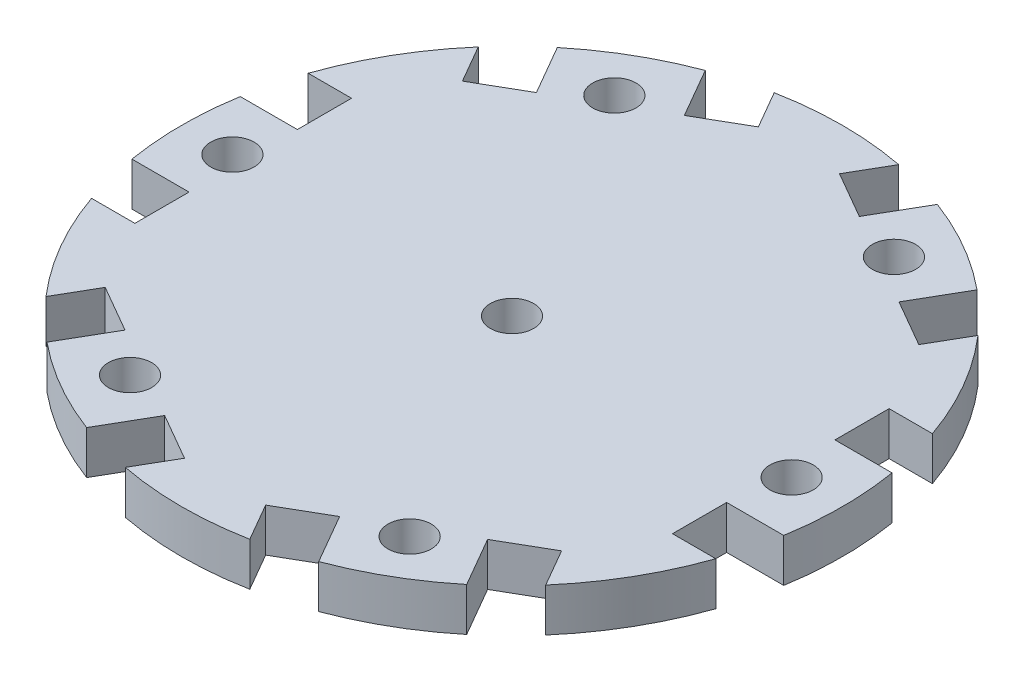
from build123d import *

# Parameters (mm, degrees)
CROQUIS1_R              = 30.5
SALIENTE_EXTRUIR1_DEPTH = 4
CROQUIS2_R              = 2
CORTAR_EXTRUIR1_DEPTH   = 4
CORTAR_EXTRUIR3_START   = -4
CORTAR_EXTRUIR3_DEPTH   = 4
CORTAR_EXTRUIR4_DEPTH   = 10


with BuildPart() as part:
    # Croquis1 → Saliente-Extruir1 (new body)
    with BuildSketch(Plane(origin=(0, 0, 0), x_dir=(1, 0, 0), z_dir=(0, 1, 0))):
        with Locations(Location((0, 0, 0), (0, 0, 270))):
            Circle(CROQUIS1_R)
    extrude(amount=SALIENTE_EXTRUIR1_DEPTH)

    # Croquis2 → Cortar-Extruir1 (cut)
    with BuildSketch(Plane(origin=(0, 4, 0), x_dir=(1, 0, 0), z_dir=(0, 1, 0))):
        with Locations(Location((0, 0, 0), (0, 0, 270))):
            Circle(CROQUIS2_R)
    extrude(amount=-CORTAR_EXTRUIR1_DEPTH, mode=Mode.SUBTRACT)

    # Croquis5 → Cortar-Extruir3 (cut)
    with BuildSketch(Plane(origin=(0, 4, 0), x_dir=(1, 0, 0), z_dir=(0, 1, 0)).offset(CORTAR_EXTRUIR3_START)):
        with BuildLine():
            ThreePointArc((-28.814059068, 10), (-29.556634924, 7.526973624), (-30.087372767, 5))
            Line((-30.087372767, 5), (-28.814059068, 5))
            Line((-28.814059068, 5), (-24.814059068, 5))
            Line((-24.814059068, 5), (-24.814059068, 10))
            Line((-24.814059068, 10), (-28.814059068, 10))
        make_face()
        with BuildLine():
            Line((28.814059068, 5), (30.087372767, 5))
            ThreePointArc((30.087372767, 5), (29.556634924, 7.526973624), (28.814059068, 10))
            Line((28.814059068, 10), (24.814059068, 10))
            Line((24.814059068, 10), (24.814059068, 5))
            Line((24.814059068, 5), (28.814059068, 5))
        make_face()
        with BuildLine():
            Line((30.087372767, -5), (28.814059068, -5))
            Line((28.814059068, -5), (24.814059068, -5))
            Line((24.814059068, -5), (24.814059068, -10))
            Line((24.814059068, -10), (28.814059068, -10))
            ThreePointArc((28.814059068, -10), (29.556634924, -7.526973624), (30.087372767, -5))
        make_face()
        with BuildLine():
            ThreePointArc((19.373813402, -23.556429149), (21.296867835, -21.833309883), (23.067283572, -19.953707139))
            Line((23.067283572, -19.953707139), (21.067283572, -16.489605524))
            Line((21.067283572, -16.489605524), (16.737156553, -18.989605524))
            Line((16.737156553, -18.989605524), (18.737156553, -22.453707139))
            Line((18.737156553, -22.453707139), (19.373813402, -23.556429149))
        make_face()
        with BuildLine():
            ThreePointArc((5.746775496, -29.953707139), (8.25976709, -29.360283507), (10.713559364, -28.556429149))
            Line((10.713559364, -28.556429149), (10.076902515, -27.453707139))
            Line((10.076902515, -27.453707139), (8.076902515, -23.989605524))
            Line((8.076902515, -23.989605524), (3.746775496, -26.489605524))
            Line((3.746775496, -26.489605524), (5.746775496, -29.953707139))
        make_face()
        with BuildLine():
            ThreePointArc((-10.713559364, -28.556429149), (-8.25976709, -29.360283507), (-5.746775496, -29.953707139))
            Line((-5.746775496, -29.953707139), (-3.746775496, -26.489605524))
            Line((-3.746775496, -26.489605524), (-8.076902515, -23.989605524))
            Line((-8.076902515, -23.989605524), (-10.076902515, -27.453707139))
            Line((-10.076902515, -27.453707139), (-10.713559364, -28.556429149))
        make_face()
        with BuildLine():
            ThreePointArc((-23.067283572, -19.953707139), (-21.296867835, -21.833309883), (-19.373813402, -23.556429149))
            Line((-19.373813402, -23.556429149), (-18.737156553, -22.453707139))
            Line((-18.737156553, -22.453707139), (-16.737156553, -18.989605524))
            Line((-16.737156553, -18.989605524), (-21.067283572, -16.489605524))
            Line((-21.067283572, -16.489605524), (-23.067283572, -19.953707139))
        make_face()
        with BuildLine():
            ThreePointArc((-30.087372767, -5), (-29.556634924, -7.526973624), (-28.814059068, -10))
            Line((-28.814059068, -10), (-24.814059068, -10))
            Line((-24.814059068, -10), (-24.814059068, -5))
            Line((-24.814059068, -5), (-28.814059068, -5))
            Line((-28.814059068, -5), (-30.087372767, -5))
        make_face()
        with BuildLine():
            Line((-18.737156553, 22.453707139), (-19.373813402, 23.556429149))
            ThreePointArc((-19.373813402, 23.556429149), (-21.296867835, 21.833309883), (-23.067283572, 19.953707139))
            Line((-23.067283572, 19.953707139), (-21.067283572, 16.489605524))
            Line((-21.067283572, 16.489605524), (-16.737156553, 18.989605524))
            Line((-16.737156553, 18.989605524), (-18.737156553, 22.453707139))
        make_face()
        with BuildLine():
            Line((-3.746775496, 26.489605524), (-5.746775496, 29.953707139))
            ThreePointArc((-5.746775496, 29.953707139), (-8.25976709, 29.360283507), (-10.713559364, 28.556429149))
            Line((-10.713559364, 28.556429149), (-10.076902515, 27.453707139))
            Line((-10.076902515, 27.453707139), (-8.076902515, 23.989605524))
            Line((-8.076902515, 23.989605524), (-3.746775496, 26.489605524))
        make_face()
        with BuildLine():
            Line((10.076902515, 27.453707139), (10.713559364, 28.556429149))
            ThreePointArc((10.713559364, 28.556429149), (8.25976709, 29.360283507), (5.746775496, 29.953707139))
            Line((5.746775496, 29.953707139), (3.746775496, 26.489605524))
            Line((3.746775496, 26.489605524), (8.076902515, 23.989605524))
            Line((8.076902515, 23.989605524), (10.076902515, 27.453707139))
        make_face()
        with BuildLine():
            Line((21.067283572, 16.489605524), (23.067283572, 19.953707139))
            ThreePointArc((23.067283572, 19.953707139), (21.296867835, 21.833309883), (19.373813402, 23.556429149))
            Line((19.373813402, 23.556429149), (18.737156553, 22.453707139))
            Line((18.737156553, 22.453707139), (16.737156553, 18.989605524))
            Line((16.737156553, 18.989605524), (21.067283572, 16.489605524))
        make_face()
    extrude(amount=CORTAR_EXTRUIR3_DEPTH, mode=Mode.SUBTRACT)

    # Croquis7 → Cortar-Extruir4 (cut)
    with BuildSketch(Plane(origin=(0, 4, 0), x_dir=(1, 0, 0), z_dir=(0, 1, 0))):
        with BuildLine():
            ThreePointArc((-13.907029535, 20.623580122), (-11.907029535, 20.623580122), (-10.907029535, 22.355630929))
            Line((-10.907029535, 22.355630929), (-12.907029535, 22.355630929))
            Line((-12.907029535, 22.355630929), (-13.907029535, 20.623580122))
        make_face()
        with BuildLine():
            Line((-12.907029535, 22.355630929), (-10.907029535, 22.355630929))
            ThreePointArc((-10.907029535, 22.355630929), (-13.907029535, 24.087681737), (-13.907029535, 20.623580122))
            Line((-13.907029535, 20.623580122), (-12.907029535, 22.355630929))
        make_face()
        with BuildLine():
            ThreePointArc((-23.81405907, 0), (-24.082008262, 1), (-24.81405907, 1.732050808))
            Line((-24.81405907, 1.732050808), (-25.81405907, 0))
            Line((-25.81405907, 0), (-24.81405907, -1.732050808))
            ThreePointArc((-24.81405907, -1.732050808), (-24.082008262, -1), (-23.81405907, 0))
        make_face()
        with BuildLine():
            Line((-25.81405907, 0), (-24.81405907, 1.732050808))
            ThreePointArc((-24.81405907, 1.732050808), (-27.81405907, 0), (-24.81405907, -1.732050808))
            Line((-24.81405907, -1.732050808), (-25.81405907, 0))
        make_face()
        with BuildLine():
            ThreePointArc((-23.81405907, 0), (-24.082008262, 1), (-24.81405907, 1.732050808))
            Line((-24.81405907, 1.732050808), (-25.81405907, 0))
            Line((-25.81405907, 0), (-24.81405907, -1.732050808))
            ThreePointArc((-24.81405907, -1.732050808), (-24.082008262, -1), (-23.81405907, 0))
        make_face()
        with BuildLine():
            Line((-25.81405907, 0), (-24.81405907, 1.732050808))
            ThreePointArc((-24.81405907, 1.732050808), (-27.81405907, 0), (-24.81405907, -1.732050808))
            Line((-24.81405907, -1.732050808), (-25.81405907, 0))
        make_face()
        with BuildLine():
            ThreePointArc((-13.907029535, 20.623580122), (-11.907029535, 20.623580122), (-10.907029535, 22.355630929))
            Line((-10.907029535, 22.355630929), (-12.907029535, 22.355630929))
            Line((-12.907029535, 22.355630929), (-13.907029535, 20.623580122))
        make_face()
        with BuildLine():
            Line((-12.907029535, 22.355630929), (-10.907029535, 22.355630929))
            ThreePointArc((-10.907029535, 22.355630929), (-13.907029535, 24.087681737), (-13.907029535, 20.623580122))
            Line((-13.907029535, 20.623580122), (-12.907029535, 22.355630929))
        make_face()
        with BuildLine():
            ThreePointArc((10.907029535, 22.355630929), (11.907029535, 20.623580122), (13.907029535, 20.623580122))
            Line((13.907029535, 20.623580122), (12.907029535, 22.355630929))
            Line((12.907029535, 22.355630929), (10.907029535, 22.355630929))
        make_face()
        with BuildLine():
            Line((12.907029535, 22.355630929), (13.907029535, 20.623580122))
            ThreePointArc((13.907029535, 20.623580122), (14.639080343, 21.355630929), (14.907029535, 22.355630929))
            ThreePointArc((14.907029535, 22.355630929), (12.907029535, 24.355630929), (10.907029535, 22.355630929))
            Line((10.907029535, 22.355630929), (12.907029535, 22.355630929))
        make_face()
        with BuildLine():
            ThreePointArc((10.907029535, 22.355630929), (11.907029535, 20.623580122), (13.907029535, 20.623580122))
            Line((13.907029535, 20.623580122), (12.907029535, 22.355630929))
            Line((12.907029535, 22.355630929), (10.907029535, 22.355630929))
        make_face()
        with BuildLine():
            Line((12.907029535, 22.355630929), (13.907029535, 20.623580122))
            ThreePointArc((13.907029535, 20.623580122), (14.639080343, 21.355630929), (14.907029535, 22.355630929))
            ThreePointArc((14.907029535, 22.355630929), (12.907029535, 24.355630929), (10.907029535, 22.355630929))
            Line((10.907029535, 22.355630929), (12.907029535, 22.355630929))
        make_face()
        with BuildLine():
            Line((24.81405907, -1.732050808), (25.81405907, 0))
            Line((25.81405907, 0), (24.81405907, 1.732050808))
            ThreePointArc((24.81405907, 1.732050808), (23.81405907, 0), (24.81405907, -1.732050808))
        make_face()
        with BuildLine():
            Line((24.81405907, 1.732050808), (25.81405907, 0))
            Line((25.81405907, 0), (24.81405907, -1.732050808))
            ThreePointArc((24.81405907, -1.732050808), (26.81405907, -1.732050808), (27.81405907, 0))
            ThreePointArc((27.81405907, 0), (26.81405907, 1.732050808), (24.81405907, 1.732050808))
        make_face()
        with BuildLine():
            Line((24.81405907, -1.732050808), (25.81405907, 0))
            Line((25.81405907, 0), (24.81405907, 1.732050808))
            ThreePointArc((24.81405907, 1.732050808), (23.81405907, 0), (24.81405907, -1.732050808))
        make_face()
        with BuildLine():
            Line((24.81405907, 1.732050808), (25.81405907, 0))
            Line((25.81405907, 0), (24.81405907, -1.732050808))
            ThreePointArc((24.81405907, -1.732050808), (26.81405907, -1.732050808), (27.81405907, 0))
            ThreePointArc((27.81405907, 0), (26.81405907, 1.732050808), (24.81405907, 1.732050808))
        make_face()
        with BuildLine():
            ThreePointArc((-13.907029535, -20.623580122), (-13.907029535, -24.087681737), (-10.907029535, -22.355630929))
            Line((-10.907029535, -22.355630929), (-12.907029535, -22.355630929))
            Line((-12.907029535, -22.355630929), (-13.907029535, -20.623580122))
        make_face()
        with BuildLine():
            Line((-12.907029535, -22.355630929), (-10.907029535, -22.355630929))
            ThreePointArc((-10.907029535, -22.355630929), (-11.907029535, -20.623580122), (-13.907029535, -20.623580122))
            Line((-13.907029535, -20.623580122), (-12.907029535, -22.355630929))
        make_face()
        with BuildLine():
            ThreePointArc((-13.907029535, -20.623580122), (-13.907029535, -24.087681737), (-10.907029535, -22.355630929))
            Line((-10.907029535, -22.355630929), (-12.907029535, -22.355630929))
            Line((-12.907029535, -22.355630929), (-13.907029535, -20.623580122))
        make_face()
        with BuildLine():
            Line((-12.907029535, -22.355630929), (-10.907029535, -22.355630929))
            ThreePointArc((-10.907029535, -22.355630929), (-11.907029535, -20.623580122), (-13.907029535, -20.623580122))
            Line((-13.907029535, -20.623580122), (-12.907029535, -22.355630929))
        make_face()
        with BuildLine():
            ThreePointArc((14.907029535, -22.355630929), (14.639080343, -21.355630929), (13.907029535, -20.623580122))
            Line((13.907029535, -20.623580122), (12.907029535, -22.355630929))
            Line((12.907029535, -22.355630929), (10.907029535, -22.355630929))
            ThreePointArc((10.907029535, -22.355630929), (12.907029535, -24.355630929), (14.907029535, -22.355630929))
        make_face()
        with BuildLine():
            Line((12.907029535, -22.355630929), (13.907029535, -20.623580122))
            ThreePointArc((13.907029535, -20.623580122), (11.907029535, -20.623580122), (10.907029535, -22.355630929))
            Line((10.907029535, -22.355630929), (12.907029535, -22.355630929))
        make_face()
        with BuildLine():
            ThreePointArc((14.907029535, -22.355630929), (14.639080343, -21.355630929), (13.907029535, -20.623580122))
            Line((13.907029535, -20.623580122), (12.907029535, -22.355630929))
            Line((12.907029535, -22.355630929), (10.907029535, -22.355630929))
            ThreePointArc((10.907029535, -22.355630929), (12.907029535, -24.355630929), (14.907029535, -22.355630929))
        make_face()
        with BuildLine():
            Line((12.907029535, -22.355630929), (13.907029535, -20.623580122))
            ThreePointArc((13.907029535, -20.623580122), (11.907029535, -20.623580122), (10.907029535, -22.355630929))
            Line((10.907029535, -22.355630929), (12.907029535, -22.355630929))
        make_face()
    extrude(amount=-CORTAR_EXTRUIR4_DEPTH, mode=Mode.SUBTRACT)


solid = part.part
